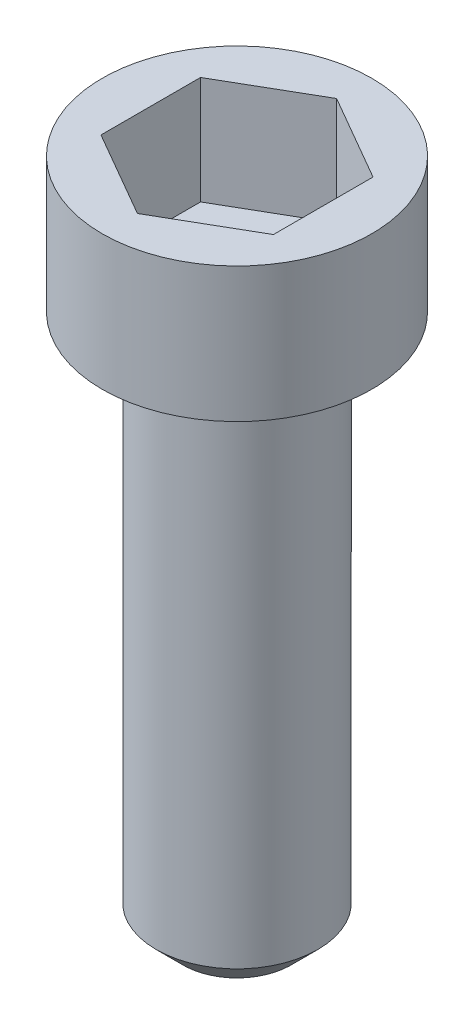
ISO-10303-21;
HEADER;
FILE_DESCRIPTION(('STEP AP214'),'2;1');
FILE_NAME('part.step','',(''),(''),'','','');
FILE_SCHEMA(('AUTOMOTIVE_DESIGN { 1 0 10303 214 1 1 1 1 }'));
ENDSEC;
DATA;
#1=APPLICATION_CONTEXT('core data for automotive mechanical design processes');
#2=APPLICATION_PROTOCOL_DEFINITION('international standard','automotive_design',2000,#1);
#3=PRODUCT_CONTEXT('',#1,'mechanical');
#4=PRODUCT('Part','Part','',(#3));
#5=PRODUCT_RELATED_PRODUCT_CATEGORY('part','',(#4));
#6=PRODUCT_DEFINITION_FORMATION('','',#4);
#7=PRODUCT_DEFINITION_CONTEXT('part definition',#1,'design');
#8=PRODUCT_DEFINITION('design','',#6,#7);
#9=PRODUCT_DEFINITION_SHAPE('','',#8);
#10=(LENGTH_UNIT() NAMED_UNIT(*) SI_UNIT(.MILLI.,.METRE.));
#11=(NAMED_UNIT(*) PLANE_ANGLE_UNIT() SI_UNIT($,.RADIAN.));
#12=(NAMED_UNIT(*) SI_UNIT($,.STERADIAN.) SOLID_ANGLE_UNIT());
#13=UNCERTAINTY_MEASURE_WITH_UNIT(LENGTH_MEASURE(1.E-05),#10,'distance_accuracy_value','');
#14=(GEOMETRIC_REPRESENTATION_CONTEXT(3) GLOBAL_UNCERTAINTY_ASSIGNED_CONTEXT((#13)) GLOBAL_UNIT_ASSIGNED_CONTEXT((#10,
#11,#12)) REPRESENTATION_CONTEXT('',''));
#15=CARTESIAN_POINT('',(0.,0.,0.));
#16=DIRECTION('',(0.,0.,1.));
#17=DIRECTION('',(1.,0.,0.));
#18=AXIS2_PLACEMENT_3D('',#15,#16,#17);
#19=CARTESIAN_POINT('',(0.,0.,0.));
#20=DIRECTION('',(0.,1.,0.));
#21=DIRECTION('',(0.,0.,1.));
#22=AXIS2_PLACEMENT_3D('',#19,#20,#21);
#23=PLANE('',#22);
#24=CARTESIAN_POINT('',(0.,0.,0.));
#25=DIRECTION('',(0.,1.,0.));
#26=DIRECTION('',(0.,0.,1.));
#27=AXIS2_PLACEMENT_3D('',#24,#25,#26);
#28=CIRCLE('',#27,2.5);
#29=CARTESIAN_POINT('',(0.,0.,2.5));
#30=VERTEX_POINT('',#29);
#31=EDGE_CURVE('E130',#30,#30,#28,.T.);
#32=ORIENTED_EDGE('',*,*,#31,.F.);
#33=EDGE_LOOP('',(#32));
#34=FACE_BOUND('',#33,.T.);
#35=CARTESIAN_POINT('',(0.,0.,0.));
#36=DIRECTION('',(0.,1.,0.));
#37=DIRECTION('',(0.,0.,1.));
#38=AXIS2_PLACEMENT_3D('',#35,#36,#37);
#39=CIRCLE('',#38,1.5);
#40=CARTESIAN_POINT('',(0.,0.,1.5));
#41=VERTEX_POINT('',#40);
#42=EDGE_CURVE('E142',#41,#41,#39,.F.);
#43=ORIENTED_EDGE('',*,*,#42,.F.);
#44=EDGE_LOOP('',(#43));
#45=FACE_BOUND('',#44,.T.);
#46=ADVANCED_FACE('F27',(#34,#45),#23,.F.);
#47=CARTESIAN_POINT('',(0.,2.5,0.));
#48=DIRECTION('',(0.,-1.,0.));
#49=DIRECTION('',(0.,0.,-1.));
#50=AXIS2_PLACEMENT_3D('',#47,#48,#49);
#51=CYLINDRICAL_SURFACE('',#50,2.5);
#52=CARTESIAN_POINT('',(0.,2.5,0.));
#53=DIRECTION('',(0.,1.,0.));
#54=DIRECTION('',(0.,0.,1.));
#55=AXIS2_PLACEMENT_3D('',#52,#53,#54);
#56=CIRCLE('',#55,2.5);
#57=CARTESIAN_POINT('',(0.,2.5,2.5));
#58=VERTEX_POINT('',#57);
#59=EDGE_CURVE('E139',#58,#58,#56,.T.);
#60=ORIENTED_EDGE('',*,*,#59,.F.);
#61=EDGE_LOOP('',(#60));
#62=FACE_BOUND('',#61,.T.);
#63=ORIENTED_EDGE('',*,*,#31,.T.);
#64=EDGE_LOOP('',(#63));
#65=FACE_BOUND('',#64,.T.);
#66=ADVANCED_FACE('F29',(#62,#65),#51,.T.);
#67=CARTESIAN_POINT('',(0.,2.5,0.));
#68=DIRECTION('',(0.,1.,0.));
#69=DIRECTION('',(0.,0.,1.));
#70=AXIS2_PLACEMENT_3D('',#67,#68,#69);
#71=PLANE('',#70);
#72=DIRECTION('',(0.866025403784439,0.,0.5));
#73=VECTOR('',#72,1.);
#74=CARTESIAN_POINT('',(-1.6,2.5,0.923760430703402));
#75=LINE('',#74,#73);
#76=CARTESIAN_POINT('',(-1.6,2.5,0.923760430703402));
#77=VERTEX_POINT('',#76);
#78=CARTESIAN_POINT('',(0.,2.5,1.8475208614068));
#79=VERTEX_POINT('',#78);
#80=EDGE_CURVE('E42',#77,#79,#75,.T.);
#81=ORIENTED_EDGE('',*,*,#80,.F.);
#82=DIRECTION('',(0.,0.,1.));
#83=VECTOR('',#82,1.);
#84=CARTESIAN_POINT('',(-1.6,2.5,-0.923760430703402));
#85=LINE('',#84,#83);
#86=CARTESIAN_POINT('',(-1.6,2.5,-0.923760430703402));
#87=VERTEX_POINT('',#86);
#88=EDGE_CURVE('E112',#87,#77,#85,.T.);
#89=ORIENTED_EDGE('',*,*,#88,.F.);
#90=DIRECTION('',(-0.866025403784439,0.,0.5));
#91=VECTOR('',#90,1.);
#92=CARTESIAN_POINT('',(0.,2.5,-1.8475208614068));
#93=LINE('',#92,#91);
#94=CARTESIAN_POINT('',(0.,2.5,-1.8475208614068));
#95=VERTEX_POINT('',#94);
#96=EDGE_CURVE('E106',#95,#87,#93,.T.);
#97=ORIENTED_EDGE('',*,*,#96,.F.);
#98=DIRECTION('',(-0.866025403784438,0.,-0.5));
#99=VECTOR('',#98,1.);
#100=CARTESIAN_POINT('',(1.6,2.5,-0.923760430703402));
#101=LINE('',#100,#99);
#102=CARTESIAN_POINT('',(1.6,2.5,-0.923760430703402));
#103=VERTEX_POINT('',#102);
#104=EDGE_CURVE('E104',#103,#95,#101,.T.);
#105=ORIENTED_EDGE('',*,*,#104,.F.);
#106=DIRECTION('',(0.,0.,-1.));
#107=VECTOR('',#106,1.);
#108=CARTESIAN_POINT('',(1.6,2.5,0.923760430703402));
#109=LINE('',#108,#107);
#110=CARTESIAN_POINT('',(1.6,2.5,0.923760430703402));
#111=VERTEX_POINT('',#110);
#112=EDGE_CURVE('E85',#111,#103,#109,.T.);
#113=ORIENTED_EDGE('',*,*,#112,.F.);
#114=DIRECTION('',(0.866025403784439,0.,-0.5));
#115=VECTOR('',#114,1.);
#116=CARTESIAN_POINT('',(0.,2.5,1.8475208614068));
#117=LINE('',#116,#115);
#118=EDGE_CURVE('E96',#79,#111,#117,.T.);
#119=ORIENTED_EDGE('',*,*,#118,.F.);
#120=EDGE_LOOP('',(#81,#89,#97,#105,#113,#119));
#121=FACE_BOUND('',#120,.T.);
#122=ORIENTED_EDGE('',*,*,#59,.T.);
#123=EDGE_LOOP('',(#122));
#124=FACE_BOUND('',#123,.T.);
#125=ADVANCED_FACE('F100',(#121,#124),#71,.T.);
#126=CARTESIAN_POINT('',(-1.6,0.5,0.923760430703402));
#127=DIRECTION('',(-0.5,0.,0.866025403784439));
#128=DIRECTION('',(0.866025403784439,0.,0.5));
#129=AXIS2_PLACEMENT_3D('',#126,#127,#128);
#130=PLANE('',#129);
#131=ORIENTED_EDGE('',*,*,#80,.T.);
#132=DIRECTION('',(0.,1.,0.));
#133=VECTOR('',#132,1.);
#134=CARTESIAN_POINT('',(0.,0.5,1.8475208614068));
#135=LINE('',#134,#133);
#136=CARTESIAN_POINT('',(0.,0.5,1.8475208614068));
#137=VERTEX_POINT('',#136);
#138=EDGE_CURVE('E93',#137,#79,#135,.T.);
#139=ORIENTED_EDGE('',*,*,#138,.F.);
#140=DIRECTION('',(0.866025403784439,0.,0.5));
#141=VECTOR('',#140,1.);
#142=CARTESIAN_POINT('',(-1.6,0.5,0.923760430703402));
#143=LINE('',#142,#141);
#144=CARTESIAN_POINT('',(-1.6,0.5,0.923760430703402));
#145=VERTEX_POINT('',#144);
#146=EDGE_CURVE('E114',#145,#137,#143,.T.);
#147=ORIENTED_EDGE('',*,*,#146,.F.);
#148=DIRECTION('',(0.,1.,0.));
#149=VECTOR('',#148,1.);
#150=CARTESIAN_POINT('',(-1.6,0.5,0.923760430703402));
#151=LINE('',#150,#149);
#152=EDGE_CURVE('E49',#145,#77,#151,.T.);
#153=ORIENTED_EDGE('',*,*,#152,.T.);
#154=EDGE_LOOP('',(#131,#139,#147,#153));
#155=FACE_BOUND('',#154,.T.);
#156=ADVANCED_FACE('F171',(#155),#130,.F.);
#157=CARTESIAN_POINT('',(-1.6,0.5,-0.923760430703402));
#158=DIRECTION('',(-1.,0.,0.));
#159=DIRECTION('',(0.,0.,1.));
#160=AXIS2_PLACEMENT_3D('',#157,#158,#159);
#161=PLANE('',#160);
#162=ORIENTED_EDGE('',*,*,#88,.T.);
#163=ORIENTED_EDGE('',*,*,#152,.F.);
#164=DIRECTION('',(0.,0.,1.));
#165=VECTOR('',#164,1.);
#166=CARTESIAN_POINT('',(-1.6,0.5,-0.923760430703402));
#167=LINE('',#166,#165);
#168=CARTESIAN_POINT('',(-1.6,0.5,-0.923760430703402));
#169=VERTEX_POINT('',#168);
#170=EDGE_CURVE('E126',#169,#145,#167,.T.);
#171=ORIENTED_EDGE('',*,*,#170,.F.);
#172=DIRECTION('',(0.,1.,0.));
#173=VECTOR('',#172,1.);
#174=CARTESIAN_POINT('',(-1.6,0.5,-0.923760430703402));
#175=LINE('',#174,#173);
#176=EDGE_CURVE('E131',#169,#87,#175,.T.);
#177=ORIENTED_EDGE('',*,*,#176,.T.);
#178=EDGE_LOOP('',(#162,#163,#171,#177));
#179=FACE_BOUND('',#178,.T.);
#180=ADVANCED_FACE('F177',(#179),#161,.F.);
#181=CARTESIAN_POINT('',(0.,0.5,-1.8475208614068));
#182=DIRECTION('',(-0.5,0.,-0.866025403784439));
#183=DIRECTION('',(-0.866025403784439,0.,0.5));
#184=AXIS2_PLACEMENT_3D('',#181,#182,#183);
#185=PLANE('',#184);
#186=ORIENTED_EDGE('',*,*,#96,.T.);
#187=ORIENTED_EDGE('',*,*,#176,.F.);
#188=DIRECTION('',(-0.866025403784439,0.,0.5));
#189=VECTOR('',#188,1.);
#190=CARTESIAN_POINT('',(0.,0.5,-1.8475208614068));
#191=LINE('',#190,#189);
#192=CARTESIAN_POINT('',(0.,0.5,-1.8475208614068));
#193=VERTEX_POINT('',#192);
#194=EDGE_CURVE('E123',#193,#169,#191,.T.);
#195=ORIENTED_EDGE('',*,*,#194,.F.);
#196=DIRECTION('',(0.,1.,0.));
#197=VECTOR('',#196,1.);
#198=CARTESIAN_POINT('',(0.,0.5,-1.8475208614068));
#199=LINE('',#198,#197);
#200=EDGE_CURVE('E133',#193,#95,#199,.T.);
#201=ORIENTED_EDGE('',*,*,#200,.T.);
#202=EDGE_LOOP('',(#186,#187,#195,#201));
#203=FACE_BOUND('',#202,.T.);
#204=ADVANCED_FACE('F181',(#203),#185,.F.);
#205=CARTESIAN_POINT('',(1.6,0.5,-0.923760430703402));
#206=DIRECTION('',(0.5,0.,-0.866025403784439));
#207=DIRECTION('',(-0.866025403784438,0.,-0.5));
#208=AXIS2_PLACEMENT_3D('',#205,#206,#207);
#209=PLANE('',#208);
#210=ORIENTED_EDGE('',*,*,#104,.T.);
#211=ORIENTED_EDGE('',*,*,#200,.F.);
#212=DIRECTION('',(-0.866025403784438,0.,-0.5));
#213=VECTOR('',#212,1.);
#214=CARTESIAN_POINT('',(1.6,0.5,-0.923760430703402));
#215=LINE('',#214,#213);
#216=CARTESIAN_POINT('',(1.6,0.5,-0.923760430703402));
#217=VERTEX_POINT('',#216);
#218=EDGE_CURVE('E120',#217,#193,#215,.T.);
#219=ORIENTED_EDGE('',*,*,#218,.F.);
#220=DIRECTION('',(0.,1.,0.));
#221=VECTOR('',#220,1.);
#222=CARTESIAN_POINT('',(1.6,0.5,-0.923760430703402));
#223=LINE('',#222,#221);
#224=EDGE_CURVE('E92',#217,#103,#223,.T.);
#225=ORIENTED_EDGE('',*,*,#224,.T.);
#226=EDGE_LOOP('',(#210,#211,#219,#225));
#227=FACE_BOUND('',#226,.T.);
#228=ADVANCED_FACE('F186',(#227),#209,.F.);
#229=CARTESIAN_POINT('',(1.6,0.5,0.923760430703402));
#230=DIRECTION('',(1.,0.,0.));
#231=DIRECTION('',(0.,0.,-1.));
#232=AXIS2_PLACEMENT_3D('',#229,#230,#231);
#233=PLANE('',#232);
#234=ORIENTED_EDGE('',*,*,#112,.T.);
#235=ORIENTED_EDGE('',*,*,#224,.F.);
#236=DIRECTION('',(0.,0.,-1.));
#237=VECTOR('',#236,1.);
#238=CARTESIAN_POINT('',(1.6,0.5,0.923760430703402));
#239=LINE('',#238,#237);
#240=CARTESIAN_POINT('',(1.6,0.5,0.923760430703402));
#241=VERTEX_POINT('',#240);
#242=EDGE_CURVE('E88',#241,#217,#239,.T.);
#243=ORIENTED_EDGE('',*,*,#242,.F.);
#244=DIRECTION('',(0.,1.,0.));
#245=VECTOR('',#244,1.);
#246=CARTESIAN_POINT('',(1.6,0.5,0.923760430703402));
#247=LINE('',#246,#245);
#248=EDGE_CURVE('E81',#241,#111,#247,.T.);
#249=ORIENTED_EDGE('',*,*,#248,.T.);
#250=EDGE_LOOP('',(#234,#235,#243,#249));
#251=FACE_BOUND('',#250,.T.);
#252=ADVANCED_FACE('F83',(#251),#233,.F.);
#253=CARTESIAN_POINT('',(0.,0.5,1.8475208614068));
#254=DIRECTION('',(0.5,0.,0.866025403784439));
#255=DIRECTION('',(0.866025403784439,0.,-0.5));
#256=AXIS2_PLACEMENT_3D('',#253,#254,#255);
#257=PLANE('',#256);
#258=ORIENTED_EDGE('',*,*,#118,.T.);
#259=ORIENTED_EDGE('',*,*,#248,.F.);
#260=DIRECTION('',(0.866025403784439,0.,-0.5));
#261=VECTOR('',#260,1.);
#262=CARTESIAN_POINT('',(0.,0.5,1.8475208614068));
#263=LINE('',#262,#261);
#264=EDGE_CURVE('E117',#137,#241,#263,.T.);
#265=ORIENTED_EDGE('',*,*,#264,.F.);
#266=ORIENTED_EDGE('',*,*,#138,.T.);
#267=EDGE_LOOP('',(#258,#259,#265,#266));
#268=FACE_BOUND('',#267,.T.);
#269=ADVANCED_FACE('F97',(#268),#257,.F.);
#270=CARTESIAN_POINT('',(0.,0.5,1.8475208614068));
#271=DIRECTION('',(0.,1.,0.));
#272=DIRECTION('',(0.,0.,1.));
#273=AXIS2_PLACEMENT_3D('',#270,#271,#272);
#274=PLANE('',#273);
#275=ORIENTED_EDGE('',*,*,#146,.T.);
#276=ORIENTED_EDGE('',*,*,#264,.T.);
#277=ORIENTED_EDGE('',*,*,#242,.T.);
#278=ORIENTED_EDGE('',*,*,#218,.T.);
#279=ORIENTED_EDGE('',*,*,#194,.T.);
#280=ORIENTED_EDGE('',*,*,#170,.T.);
#281=EDGE_LOOP('',(#275,#276,#277,#278,#279,#280));
#282=FACE_BOUND('',#281,.T.);
#283=ADVANCED_FACE('F190',(#282),#274,.T.);
#284=CARTESIAN_POINT('',(0.,-10.,0.));
#285=DIRECTION('',(0.,1.,0.));
#286=DIRECTION('',(0.,0.,1.));
#287=AXIS2_PLACEMENT_3D('',#284,#285,#286);
#288=CYLINDRICAL_SURFACE('',#287,1.5);
#289=CARTESIAN_POINT('',(0.,-9.5,0.));
#290=DIRECTION('',(0.,-1.,0.));
#291=DIRECTION('',(0.,0.,-1.));
#292=AXIS2_PLACEMENT_3D('',#289,#290,#291);
#293=CIRCLE('',#292,1.5);
#294=CARTESIAN_POINT('',(0.,-9.5,-1.5));
#295=VERTEX_POINT('',#294);
#296=EDGE_CURVE('E11',#295,#295,#293,.F.);
#297=ORIENTED_EDGE('',*,*,#296,.T.);
#298=EDGE_LOOP('',(#297));
#299=FACE_BOUND('',#298,.T.);
#300=ORIENTED_EDGE('',*,*,#42,.T.);
#301=EDGE_LOOP('',(#300));
#302=FACE_BOUND('',#301,.T.);
#303=ADVANCED_FACE('F156',(#299,#302),#288,.T.);
#304=CARTESIAN_POINT('',(0.,-10.,0.));
#305=DIRECTION('',(0.,-1.,0.));
#306=DIRECTION('',(0.,0.,-1.));
#307=AXIS2_PLACEMENT_3D('',#304,#305,#306);
#308=PLANE('',#307);
#309=CARTESIAN_POINT('',(0.,-10.,0.));
#310=DIRECTION('',(0.,-1.,0.));
#311=DIRECTION('',(0.,0.,-1.));
#312=AXIS2_PLACEMENT_3D('',#309,#310,#311);
#313=CIRCLE('',#312,0.999999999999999);
#314=CARTESIAN_POINT('',(0.,-10.,-0.999999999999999));
#315=VERTEX_POINT('',#314);
#316=EDGE_CURVE('E35',#315,#315,#313,.T.);
#317=ORIENTED_EDGE('',*,*,#316,.T.);
#318=EDGE_LOOP('',(#317));
#319=FACE_BOUND('',#318,.T.);
#320=ADVANCED_FACE('F147',(#319),#308,.T.);
#321=CARTESIAN_POINT('',(0.,-10.,0.));
#322=DIRECTION('',(0.,1.,0.));
#323=DIRECTION('',(0.,0.,1.));
#324=AXIS2_PLACEMENT_3D('',#321,#322,#323);
#325=CONICAL_SURFACE('',#324,0.999999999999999,0.785398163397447);
#326=ORIENTED_EDGE('',*,*,#296,.F.);
#327=EDGE_LOOP('',(#326));
#328=FACE_BOUND('',#327,.T.);
#329=ORIENTED_EDGE('',*,*,#316,.F.);
#330=EDGE_LOOP('',(#329));
#331=FACE_BOUND('',#330,.T.);
#332=ADVANCED_FACE('F149',(#328,#331),#325,.T.);
#333=CLOSED_SHELL('',(#46,#66,#125,#156,#180,#204,#228,#252,#269,#283,#303,#320,#332));
#334=MANIFOLD_SOLID_BREP('B2',#333);
#335=ADVANCED_BREP_SHAPE_REPRESENTATION('',(#18,#334),#14);
#336=SHAPE_DEFINITION_REPRESENTATION(#9,#335);
ENDSEC;
END-ISO-10303-21;
